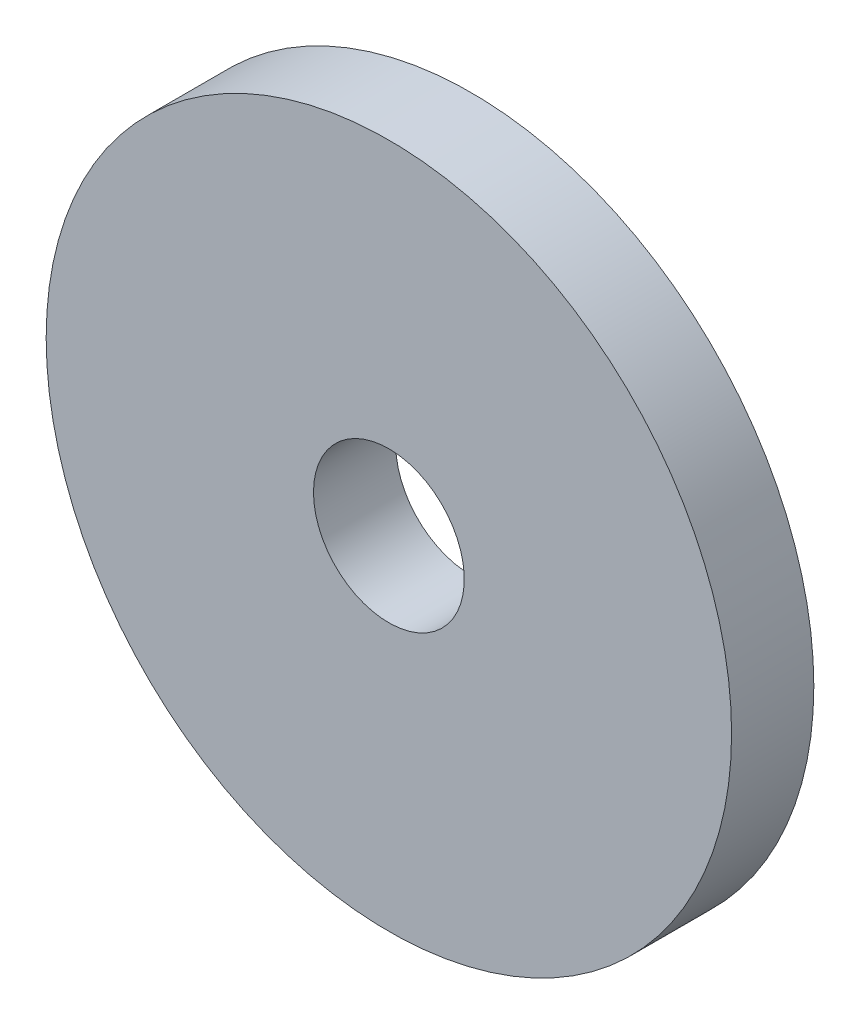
ISO-10303-21;
HEADER;
FILE_DESCRIPTION(('STEP AP214'),'2;1');
FILE_NAME('part.step','',(''),(''),'','','');
FILE_SCHEMA(('AUTOMOTIVE_DESIGN { 1 0 10303 214 1 1 1 1 }'));
ENDSEC;
DATA;
#1=APPLICATION_CONTEXT('core data for automotive mechanical design processes');
#2=APPLICATION_PROTOCOL_DEFINITION('international standard','automotive_design',2000,#1);
#3=PRODUCT_CONTEXT('',#1,'mechanical');
#4=PRODUCT('Part','Part','',(#3));
#5=PRODUCT_RELATED_PRODUCT_CATEGORY('part','',(#4));
#6=PRODUCT_DEFINITION_FORMATION('','',#4);
#7=PRODUCT_DEFINITION_CONTEXT('part definition',#1,'design');
#8=PRODUCT_DEFINITION('design','',#6,#7);
#9=PRODUCT_DEFINITION_SHAPE('','',#8);
#10=(LENGTH_UNIT() NAMED_UNIT(*) SI_UNIT(.MILLI.,.METRE.));
#11=(NAMED_UNIT(*) PLANE_ANGLE_UNIT() SI_UNIT($,.RADIAN.));
#12=(NAMED_UNIT(*) SI_UNIT($,.STERADIAN.) SOLID_ANGLE_UNIT());
#13=UNCERTAINTY_MEASURE_WITH_UNIT(LENGTH_MEASURE(1.E-05),#10,'distance_accuracy_value','');
#14=(GEOMETRIC_REPRESENTATION_CONTEXT(3) GLOBAL_UNCERTAINTY_ASSIGNED_CONTEXT((#13)) GLOBAL_UNIT_ASSIGNED_CONTEXT((#10,
#11,#12)) REPRESENTATION_CONTEXT('',''));
#15=CARTESIAN_POINT('',(0.,0.,0.));
#16=DIRECTION('',(0.,0.,1.));
#17=DIRECTION('',(1.,0.,0.));
#18=AXIS2_PLACEMENT_3D('',#15,#16,#17);
#19=CARTESIAN_POINT('',(0.,0.,0.762));
#20=DIRECTION('',(0.,0.,1.));
#21=DIRECTION('',(1.,0.,0.));
#22=AXIS2_PLACEMENT_3D('',#19,#20,#21);
#23=PLANE('',#22);
#24=CARTESIAN_POINT('',(0.,0.,0.762));
#25=DIRECTION('',(0.,0.,1.));
#26=DIRECTION('',(1.,0.,0.));
#27=AXIS2_PLACEMENT_3D('',#24,#25,#26);
#28=CIRCLE('',#27,3.175);
#29=CARTESIAN_POINT('',(-3.175,0.,0.762));
#30=VERTEX_POINT('',#29);
#31=EDGE_CURVE('E10',#30,#30,#28,.T.);
#32=ORIENTED_EDGE('',*,*,#31,.T.);
#33=EDGE_LOOP('',(#32));
#34=FACE_BOUND('',#33,.T.);
#35=CARTESIAN_POINT('',(0.,0.,0.762));
#36=DIRECTION('',(0.,0.,1.));
#37=DIRECTION('',(1.,0.,0.));
#38=AXIS2_PLACEMENT_3D('',#35,#36,#37);
#39=CIRCLE('',#38,0.6985);
#40=CARTESIAN_POINT('',(-0.6985,0.,0.762));
#41=VERTEX_POINT('',#40);
#42=EDGE_CURVE('E43',#41,#41,#39,.T.);
#43=ORIENTED_EDGE('',*,*,#42,.F.);
#44=EDGE_LOOP('',(#43));
#45=FACE_BOUND('',#44,.T.);
#46=ADVANCED_FACE('F32',(#34,#45),#23,.T.);
#47=CARTESIAN_POINT('',(0.,0.,0.));
#48=DIRECTION('',(0.,0.,1.));
#49=DIRECTION('',(1.,0.,0.));
#50=AXIS2_PLACEMENT_3D('',#47,#48,#49);
#51=PLANE('',#50);
#52=CARTESIAN_POINT('',(0.,0.,0.));
#53=DIRECTION('',(0.,0.,1.));
#54=DIRECTION('',(1.,0.,0.));
#55=AXIS2_PLACEMENT_3D('',#52,#53,#54);
#56=CIRCLE('',#55,3.175);
#57=CARTESIAN_POINT('',(-3.175,0.,0.));
#58=VERTEX_POINT('',#57);
#59=EDGE_CURVE('E36',#58,#58,#56,.T.);
#60=ORIENTED_EDGE('',*,*,#59,.F.);
#61=EDGE_LOOP('',(#60));
#62=FACE_BOUND('',#61,.T.);
#63=CARTESIAN_POINT('',(0.,0.,0.));
#64=DIRECTION('',(0.,0.,1.));
#65=DIRECTION('',(1.,0.,0.));
#66=AXIS2_PLACEMENT_3D('',#63,#64,#65);
#67=CIRCLE('',#66,0.6985);
#68=CARTESIAN_POINT('',(-0.6985,0.,0.));
#69=VERTEX_POINT('',#68);
#70=EDGE_CURVE('E45',#69,#69,#67,.T.);
#71=ORIENTED_EDGE('',*,*,#70,.T.);
#72=EDGE_LOOP('',(#71));
#73=FACE_BOUND('',#72,.T.);
#74=ADVANCED_FACE('F55',(#62,#73),#51,.F.);
#75=CARTESIAN_POINT('',(0.,0.,0.762));
#76=DIRECTION('',(0.,0.,-1.));
#77=DIRECTION('',(-1.,0.,0.));
#78=AXIS2_PLACEMENT_3D('',#75,#76,#77);
#79=CYLINDRICAL_SURFACE('',#78,3.175);
#80=CARTESIAN_POINT('',(-3.175,0.,0.762));
#81=CARTESIAN_POINT('',(-3.175,0.,0.7540625));
#82=CARTESIAN_POINT('',(-3.175,0.,0.746125));
#83=CARTESIAN_POINT('',(-3.175,0.,0.73025));
#84=CARTESIAN_POINT('',(-3.175,0.,0.7223125));
#85=CARTESIAN_POINT('',(-3.175,0.,0.7064375));
#86=CARTESIAN_POINT('',(-3.175,0.,0.6985));
#87=CARTESIAN_POINT('',(-3.175,0.,0.682625));
#88=CARTESIAN_POINT('',(-3.175,0.,0.6746875));
#89=CARTESIAN_POINT('',(-3.175,0.,0.6588125));
#90=CARTESIAN_POINT('',(-3.175,0.,0.650875));
#91=CARTESIAN_POINT('',(-3.175,0.,0.635));
#92=CARTESIAN_POINT('',(-3.175,0.,0.6270625));
#93=CARTESIAN_POINT('',(-3.175,0.,0.6111875));
#94=CARTESIAN_POINT('',(-3.175,0.,0.60325));
#95=CARTESIAN_POINT('',(-3.175,0.,0.587375));
#96=CARTESIAN_POINT('',(-3.175,0.,0.5794375));
#97=CARTESIAN_POINT('',(-3.175,0.,0.5635625));
#98=CARTESIAN_POINT('',(-3.175,0.,0.555625));
#99=CARTESIAN_POINT('',(-3.175,0.,0.53975));
#100=CARTESIAN_POINT('',(-3.175,0.,0.5318125));
#101=CARTESIAN_POINT('',(-3.175,0.,0.5159375));
#102=CARTESIAN_POINT('',(-3.175,0.,0.508));
#103=CARTESIAN_POINT('',(-3.175,0.,0.492125));
#104=CARTESIAN_POINT('',(-3.175,0.,0.4841875));
#105=CARTESIAN_POINT('',(-3.175,0.,0.4683125));
#106=CARTESIAN_POINT('',(-3.175,0.,0.460375));
#107=CARTESIAN_POINT('',(-3.175,0.,0.4445));
#108=CARTESIAN_POINT('',(-3.175,0.,0.4365625));
#109=CARTESIAN_POINT('',(-3.175,0.,0.4206875));
#110=CARTESIAN_POINT('',(-3.175,0.,0.41275));
#111=CARTESIAN_POINT('',(-3.175,0.,0.396875));
#112=CARTESIAN_POINT('',(-3.175,0.,0.3889375));
#113=CARTESIAN_POINT('',(-3.175,0.,0.3730625));
#114=CARTESIAN_POINT('',(-3.175,0.,0.365125));
#115=CARTESIAN_POINT('',(-3.175,0.,0.34925));
#116=CARTESIAN_POINT('',(-3.175,0.,0.3413125));
#117=CARTESIAN_POINT('',(-3.175,0.,0.3254375));
#118=CARTESIAN_POINT('',(-3.175,0.,0.3175));
#119=CARTESIAN_POINT('',(-3.175,0.,0.301625));
#120=CARTESIAN_POINT('',(-3.175,0.,0.2936875));
#121=CARTESIAN_POINT('',(-3.175,0.,0.2778125));
#122=CARTESIAN_POINT('',(-3.175,0.,0.269875));
#123=CARTESIAN_POINT('',(-3.175,0.,0.254));
#124=CARTESIAN_POINT('',(-3.175,0.,0.2460625));
#125=CARTESIAN_POINT('',(-3.175,0.,0.2301875));
#126=CARTESIAN_POINT('',(-3.175,0.,0.22225));
#127=CARTESIAN_POINT('',(-3.175,0.,0.206375));
#128=CARTESIAN_POINT('',(-3.175,0.,0.1984375));
#129=CARTESIAN_POINT('',(-3.175,0.,0.1825625));
#130=CARTESIAN_POINT('',(-3.175,0.,0.174625));
#131=CARTESIAN_POINT('',(-3.175,0.,0.15875));
#132=CARTESIAN_POINT('',(-3.175,0.,0.1508125));
#133=CARTESIAN_POINT('',(-3.175,0.,0.1349375));
#134=CARTESIAN_POINT('',(-3.175,0.,0.127));
#135=CARTESIAN_POINT('',(-3.175,0.,0.111125));
#136=CARTESIAN_POINT('',(-3.175,0.,0.1031875));
#137=CARTESIAN_POINT('',(-3.175,0.,0.0873125));
#138=CARTESIAN_POINT('',(-3.175,0.,0.079375));
#139=CARTESIAN_POINT('',(-3.175,0.,0.0635));
#140=CARTESIAN_POINT('',(-3.175,0.,0.0555625));
#141=CARTESIAN_POINT('',(-3.175,0.,0.0396875));
#142=CARTESIAN_POINT('',(-3.175,0.,0.03175));
#143=CARTESIAN_POINT('',(-3.175,0.,0.015875));
#144=CARTESIAN_POINT('',(-3.175,0.,0.00793749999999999));
#145=CARTESIAN_POINT('',(-3.175,0.,0.));
#146=B_SPLINE_CURVE_WITH_KNOTS('',3,(#80,#81,#82,#83,#84,#85,#86,#87,#88,#89,#90,#91,#92,#93,
#94,#95,#96,#97,#98,#99,#100,#101,#102,#103,#104,#105,#106,#107,#108,#109,#110,#111,#112,#113,
#114,#115,#116,#117,#118,#119,#120,#121,#122,#123,#124,#125,#126,#127,#128,#129,#130,#131,#132,
#133,#134,#135,#136,#137,#138,#139,#140,#141,#142,#143,#144,#145),.UNSPECIFIED.,.F.,.F.,(4,2,2,
2,2,2,2,2,2,2,2,2,2,2,2,2,2,2,2,2,2,2,2,2,2,2,2,2,2,2,2,2,4),(0.,0.0238125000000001,0.047625,
0.0714375,0.0952500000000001,0.1190625,0.142875,0.1666875,0.1905,0.2143125,0.238125,0.2619375,
0.28575,0.3095625,0.333375,0.3571875,0.381,0.4048125,0.428625,0.4524375,0.47625,0.5000625,
0.523875,0.5476875,0.5715,0.5953125,0.619125,0.6429375,0.66675,0.6905625,0.714375,0.7381875,
0.762),.UNSPECIFIED.);
#147=EDGE_CURVE('BSEAM34',#30,#58,#146,.T.);
#148=ORIENTED_EDGE('',*,*,#31,.F.);
#149=ORIENTED_EDGE('',*,*,#59,.T.);
#150=ORIENTED_EDGE('',*,*,#147,.T.);
#151=ORIENTED_EDGE('',*,*,#147,.F.);
#152=EDGE_LOOP('',(#148,#150,#149,#151));
#153=FACE_BOUND('',#152,.T.);
#154=ADVANCED_FACE('F34',(#153),#79,.T.);
#155=CARTESIAN_POINT('',(0.,0.,0.762));
#156=DIRECTION('',(0.,0.,-1.));
#157=DIRECTION('',(-1.,0.,0.));
#158=AXIS2_PLACEMENT_3D('',#155,#156,#157);
#159=CYLINDRICAL_SURFACE('',#158,0.6985);
#160=CARTESIAN_POINT('',(-0.6985,0.,0.762));
#161=CARTESIAN_POINT('',(-0.6985,0.,0.7540625));
#162=CARTESIAN_POINT('',(-0.6985,0.,0.746125));
#163=CARTESIAN_POINT('',(-0.6985,0.,0.73025));
#164=CARTESIAN_POINT('',(-0.6985,0.,0.7223125));
#165=CARTESIAN_POINT('',(-0.6985,0.,0.7064375));
#166=CARTESIAN_POINT('',(-0.6985,0.,0.6985));
#167=CARTESIAN_POINT('',(-0.6985,0.,0.682625));
#168=CARTESIAN_POINT('',(-0.6985,0.,0.6746875));
#169=CARTESIAN_POINT('',(-0.6985,0.,0.6588125));
#170=CARTESIAN_POINT('',(-0.6985,0.,0.650875));
#171=CARTESIAN_POINT('',(-0.6985,0.,0.635));
#172=CARTESIAN_POINT('',(-0.6985,0.,0.6270625));
#173=CARTESIAN_POINT('',(-0.6985,0.,0.6111875));
#174=CARTESIAN_POINT('',(-0.6985,0.,0.60325));
#175=CARTESIAN_POINT('',(-0.6985,0.,0.587375));
#176=CARTESIAN_POINT('',(-0.6985,0.,0.5794375));
#177=CARTESIAN_POINT('',(-0.6985,0.,0.5635625));
#178=CARTESIAN_POINT('',(-0.6985,0.,0.555625));
#179=CARTESIAN_POINT('',(-0.6985,0.,0.53975));
#180=CARTESIAN_POINT('',(-0.6985,0.,0.5318125));
#181=CARTESIAN_POINT('',(-0.6985,0.,0.5159375));
#182=CARTESIAN_POINT('',(-0.6985,0.,0.508));
#183=CARTESIAN_POINT('',(-0.6985,0.,0.492125));
#184=CARTESIAN_POINT('',(-0.6985,0.,0.4841875));
#185=CARTESIAN_POINT('',(-0.6985,0.,0.4683125));
#186=CARTESIAN_POINT('',(-0.6985,0.,0.460375));
#187=CARTESIAN_POINT('',(-0.6985,0.,0.4445));
#188=CARTESIAN_POINT('',(-0.6985,0.,0.4365625));
#189=CARTESIAN_POINT('',(-0.6985,0.,0.4206875));
#190=CARTESIAN_POINT('',(-0.6985,0.,0.41275));
#191=CARTESIAN_POINT('',(-0.6985,0.,0.396875));
#192=CARTESIAN_POINT('',(-0.6985,0.,0.3889375));
#193=CARTESIAN_POINT('',(-0.6985,0.,0.3730625));
#194=CARTESIAN_POINT('',(-0.6985,0.,0.365125));
#195=CARTESIAN_POINT('',(-0.6985,0.,0.34925));
#196=CARTESIAN_POINT('',(-0.6985,0.,0.3413125));
#197=CARTESIAN_POINT('',(-0.6985,0.,0.3254375));
#198=CARTESIAN_POINT('',(-0.6985,0.,0.3175));
#199=CARTESIAN_POINT('',(-0.6985,0.,0.301625));
#200=CARTESIAN_POINT('',(-0.6985,0.,0.2936875));
#201=CARTESIAN_POINT('',(-0.6985,0.,0.2778125));
#202=CARTESIAN_POINT('',(-0.6985,0.,0.269875));
#203=CARTESIAN_POINT('',(-0.6985,0.,0.254));
#204=CARTESIAN_POINT('',(-0.6985,0.,0.2460625));
#205=CARTESIAN_POINT('',(-0.6985,0.,0.2301875));
#206=CARTESIAN_POINT('',(-0.6985,0.,0.22225));
#207=CARTESIAN_POINT('',(-0.6985,0.,0.206375));
#208=CARTESIAN_POINT('',(-0.6985,0.,0.1984375));
#209=CARTESIAN_POINT('',(-0.6985,0.,0.1825625));
#210=CARTESIAN_POINT('',(-0.6985,0.,0.174625));
#211=CARTESIAN_POINT('',(-0.6985,0.,0.15875));
#212=CARTESIAN_POINT('',(-0.6985,0.,0.1508125));
#213=CARTESIAN_POINT('',(-0.6985,0.,0.1349375));
#214=CARTESIAN_POINT('',(-0.6985,0.,0.127));
#215=CARTESIAN_POINT('',(-0.6985,0.,0.111125));
#216=CARTESIAN_POINT('',(-0.6985,0.,0.1031875));
#217=CARTESIAN_POINT('',(-0.6985,0.,0.0873125));
#218=CARTESIAN_POINT('',(-0.6985,0.,0.079375));
#219=CARTESIAN_POINT('',(-0.6985,0.,0.0635));
#220=CARTESIAN_POINT('',(-0.6985,0.,0.0555625));
#221=CARTESIAN_POINT('',(-0.6985,0.,0.0396875));
#222=CARTESIAN_POINT('',(-0.6985,0.,0.03175));
#223=CARTESIAN_POINT('',(-0.6985,0.,0.015875));
#224=CARTESIAN_POINT('',(-0.6985,0.,0.00793749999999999));
#225=CARTESIAN_POINT('',(-0.6985,0.,0.));
#226=B_SPLINE_CURVE_WITH_KNOTS('',3,(#160,#161,#162,#163,#164,#165,#166,#167,#168,#169,#170,
#171,#172,#173,#174,#175,#176,#177,#178,#179,#180,#181,#182,#183,#184,#185,#186,#187,#188,#189,
#190,#191,#192,#193,#194,#195,#196,#197,#198,#199,#200,#201,#202,#203,#204,#205,#206,#207,#208,
#209,#210,#211,#212,#213,#214,#215,#216,#217,#218,#219,#220,#221,#222,#223,#224,#225),
.UNSPECIFIED.,.F.,.F.,(4,2,2,2,2,2,2,2,2,2,2,2,2,2,2,2,2,2,2,2,2,2,2,2,2,2,2,2,2,2,2,2,4),(0.,
0.0238125,0.0476249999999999,0.0714374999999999,0.09525,0.1190625,0.142875,0.1666875,0.1905,
0.2143125,0.238125,0.2619375,0.28575,0.3095625,0.333375,0.3571875,0.381,0.4048125,0.428625,
0.4524375,0.47625,0.5000625,0.523875,0.5476875,0.5715,0.5953125,0.619125,0.6429375,0.66675,
0.6905625,0.714375,0.7381875,0.762),.UNSPECIFIED.);
#227=EDGE_CURVE('BSEAM51',#41,#69,#226,.T.);
#228=ORIENTED_EDGE('',*,*,#42,.T.);
#229=ORIENTED_EDGE('',*,*,#70,.F.);
#230=ORIENTED_EDGE('',*,*,#227,.T.);
#231=ORIENTED_EDGE('',*,*,#227,.F.);
#232=EDGE_LOOP('',(#228,#230,#229,#231));
#233=FACE_BOUND('',#232,.T.);
#234=ADVANCED_FACE('F51',(#233),#159,.F.);
#235=CLOSED_SHELL('',(#46,#74,#154,#234));
#236=MANIFOLD_SOLID_BREP('B2',#235);
#237=ADVANCED_BREP_SHAPE_REPRESENTATION('',(#18,#236),#14);
#238=SHAPE_DEFINITION_REPRESENTATION(#9,#237);
ENDSEC;
END-ISO-10303-21;
